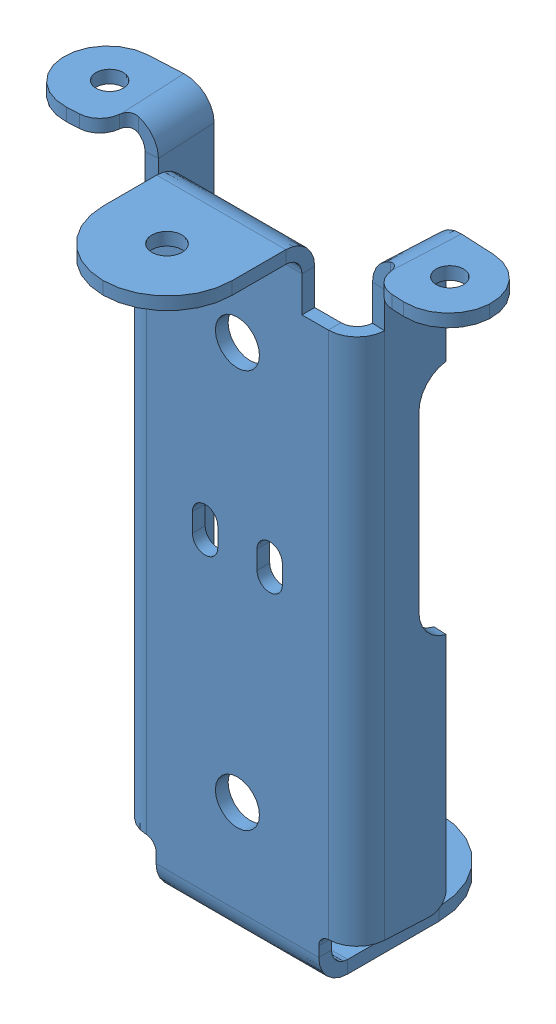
SolidWorks assembly Pop Bumper Bkt and Stop ASSY B-7417.SLDASM, configuration Default (file format 6000). Lengths in mm.
Overall size (63.03 96.02 49.47).
2 component instances, 2 part files, 2 mates.
Components (placement in the parent):
- Pop Bumper Bkt-1: Pop Bumper Bkt.SLDPRT [Default] at origin size (63.03 94.73 49.47)
- Pop Bumper Coil Stop WPC-1: Pop Bumper Coil Stop WPC.SLDPRT [Default] at (0 -5.3848 1.27) x (1 0 0) z (0 -1 0) size (11.05 11.05 9.47)
Mates (geometry in assembly coordinates):
- Coincident1: coincident anti-aligned: plane of Pop Bumper Bkt-1 through (0.0635 -5.3848 1.3335) normal (0 1 0); plane of Pop Bumper Coil Stop WPC-1 through (0 -5.3848 1.27) normal (0 -1 0)
- Concentric1: concentric aligned: cylinder of Pop Bumper Bkt-1 through (0 -7.2644 1.27) axis (0 1 0) radius 3.1496; cylinder of Pop Bumper Coil Stop WPC-1 through (0 -8.5598 1.27) axis (0 1 0) radius 3.5687
